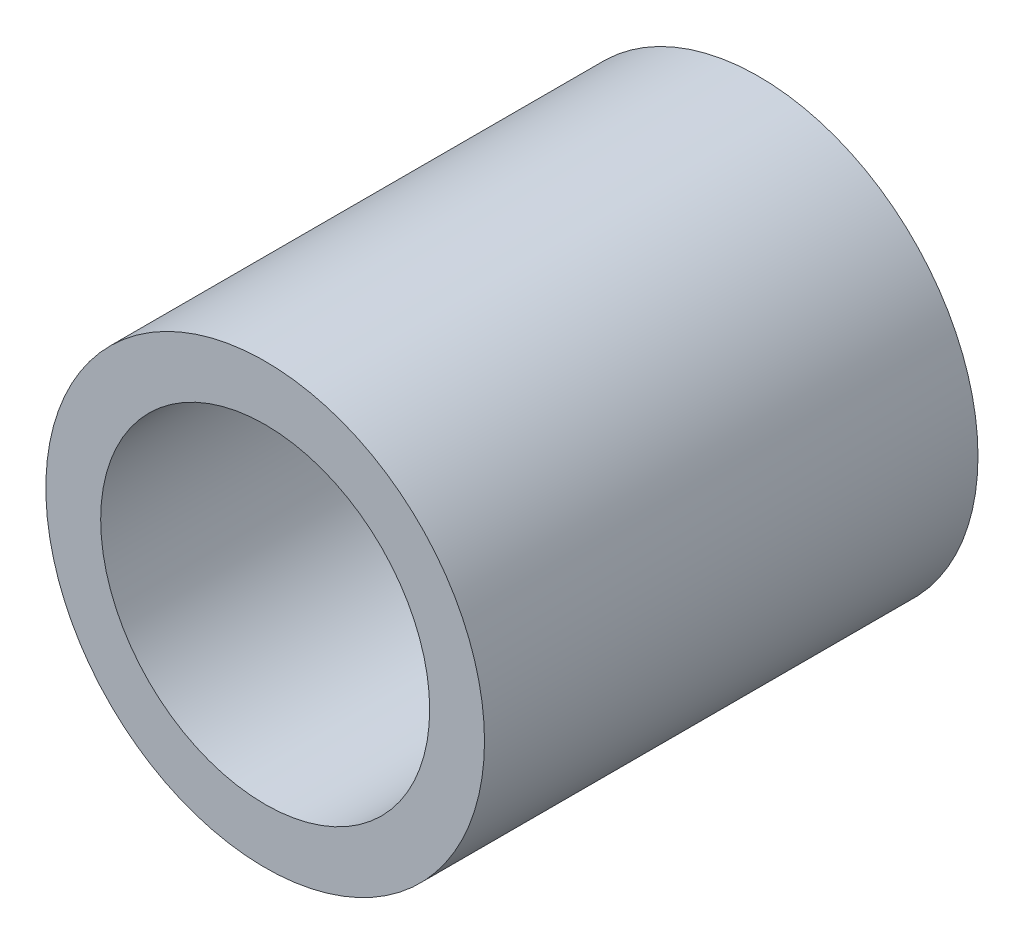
ISO-10303-21;
HEADER;
FILE_DESCRIPTION(('STEP AP214'),'2;1');
FILE_NAME('part.step','',(''),(''),'','','');
FILE_SCHEMA(('AUTOMOTIVE_DESIGN { 1 0 10303 214 1 1 1 1 }'));
ENDSEC;
DATA;
#1=APPLICATION_CONTEXT('core data for automotive mechanical design processes');
#2=APPLICATION_PROTOCOL_DEFINITION('international standard','automotive_design',2000,#1);
#3=PRODUCT_CONTEXT('',#1,'mechanical');
#4=PRODUCT('Part','Part','',(#3));
#5=PRODUCT_RELATED_PRODUCT_CATEGORY('part','',(#4));
#6=PRODUCT_DEFINITION_FORMATION('','',#4);
#7=PRODUCT_DEFINITION_CONTEXT('part definition',#1,'design');
#8=PRODUCT_DEFINITION('design','',#6,#7);
#9=PRODUCT_DEFINITION_SHAPE('','',#8);
#10=(LENGTH_UNIT() NAMED_UNIT(*) SI_UNIT(.MILLI.,.METRE.));
#11=(NAMED_UNIT(*) PLANE_ANGLE_UNIT() SI_UNIT($,.RADIAN.));
#12=(NAMED_UNIT(*) SI_UNIT($,.STERADIAN.) SOLID_ANGLE_UNIT());
#13=UNCERTAINTY_MEASURE_WITH_UNIT(LENGTH_MEASURE(1.E-05),#10,'distance_accuracy_value','');
#14=(GEOMETRIC_REPRESENTATION_CONTEXT(3) GLOBAL_UNCERTAINTY_ASSIGNED_CONTEXT((#13)) GLOBAL_UNIT_ASSIGNED_CONTEXT((#10,
#11,#12)) REPRESENTATION_CONTEXT('',''));
#15=CARTESIAN_POINT('',(0.,0.,0.));
#16=DIRECTION('',(0.,0.,1.));
#17=DIRECTION('',(1.,0.,0.));
#18=AXIS2_PLACEMENT_3D('',#15,#16,#17);
#19=CARTESIAN_POINT('',(0.,0.,64.4960244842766));
#20=DIRECTION('',(0.,0.,-1.));
#21=DIRECTION('',(-1.,0.,0.));
#22=AXIS2_PLACEMENT_3D('',#19,#20,#21);
#23=CYLINDRICAL_SURFACE('',#22,12.7);
#24=CARTESIAN_POINT('',(0.,0.,0.));
#25=DIRECTION('',(0.,0.,1.));
#26=DIRECTION('',(1.,0.,0.));
#27=AXIS2_PLACEMENT_3D('',#24,#25,#26);
#28=CIRCLE('',#27,12.7);
#29=CARTESIAN_POINT('',(12.7,0.,0.));
#30=VERTEX_POINT('',#29);
#31=EDGE_CURVE('E46',#30,#30,#28,.T.);
#32=ORIENTED_EDGE('',*,*,#31,.T.);
#33=EDGE_LOOP('',(#32));
#34=FACE_BOUND('',#33,.T.);
#35=CARTESIAN_POINT('',(0.,0.,28.575));
#36=DIRECTION('',(0.,0.,1.));
#37=DIRECTION('',(1.,0.,0.));
#38=AXIS2_PLACEMENT_3D('',#35,#36,#37);
#39=CIRCLE('',#38,12.7);
#40=CARTESIAN_POINT('',(12.7,0.,28.575));
#41=VERTEX_POINT('',#40);
#42=EDGE_CURVE('E10',#41,#41,#39,.T.);
#43=ORIENTED_EDGE('',*,*,#42,.F.);
#44=EDGE_LOOP('',(#43));
#45=FACE_BOUND('',#44,.T.);
#46=ADVANCED_FACE('F39',(#34,#45),#23,.T.);
#47=CARTESIAN_POINT('',(0.,0.,0.));
#48=DIRECTION('',(0.,0.,1.));
#49=DIRECTION('',(1.,0.,0.));
#50=AXIS2_PLACEMENT_3D('',#47,#48,#49);
#51=PLANE('',#50);
#52=CARTESIAN_POINT('',(0.,0.,0.));
#53=DIRECTION('',(0.,0.,1.));
#54=DIRECTION('',(1.,0.,0.));
#55=AXIS2_PLACEMENT_3D('',#52,#53,#54);
#56=CIRCLE('',#55,9.525);
#57=CARTESIAN_POINT('',(9.525,0.,0.));
#58=VERTEX_POINT('',#57);
#59=EDGE_CURVE('E50',#58,#58,#56,.T.);
#60=ORIENTED_EDGE('',*,*,#59,.T.);
#61=EDGE_LOOP('',(#60));
#62=FACE_BOUND('',#61,.T.);
#63=ORIENTED_EDGE('',*,*,#31,.F.);
#64=EDGE_LOOP('',(#63));
#65=FACE_BOUND('',#64,.T.);
#66=ADVANCED_FACE('F63',(#62,#65),#51,.F.);
#67=CARTESIAN_POINT('',(0.,0.,28.575));
#68=DIRECTION('',(0.,0.,1.));
#69=DIRECTION('',(1.,0.,0.));
#70=AXIS2_PLACEMENT_3D('',#67,#68,#69);
#71=PLANE('',#70);
#72=CARTESIAN_POINT('',(0.,0.,28.575));
#73=DIRECTION('',(0.,0.,1.));
#74=DIRECTION('',(1.,0.,0.));
#75=AXIS2_PLACEMENT_3D('',#72,#73,#74);
#76=CIRCLE('',#75,9.525);
#77=CARTESIAN_POINT('',(9.525,0.,28.575));
#78=VERTEX_POINT('',#77);
#79=EDGE_CURVE('E54',#78,#78,#76,.T.);
#80=ORIENTED_EDGE('',*,*,#79,.F.);
#81=EDGE_LOOP('',(#80));
#82=FACE_BOUND('',#81,.T.);
#83=ORIENTED_EDGE('',*,*,#42,.T.);
#84=EDGE_LOOP('',(#83));
#85=FACE_BOUND('',#84,.T.);
#86=ADVANCED_FACE('F41',(#82,#85),#71,.T.);
#87=CARTESIAN_POINT('',(0.,0.,0.));
#88=DIRECTION('',(0.,0.,1.));
#89=DIRECTION('',(1.,0.,0.));
#90=AXIS2_PLACEMENT_3D('',#87,#88,#89);
#91=CYLINDRICAL_SURFACE('',#90,9.525);
#92=ORIENTED_EDGE('',*,*,#59,.F.);
#93=EDGE_LOOP('',(#92));
#94=FACE_BOUND('',#93,.T.);
#95=ORIENTED_EDGE('',*,*,#79,.T.);
#96=EDGE_LOOP('',(#95));
#97=FACE_BOUND('',#96,.T.);
#98=ADVANCED_FACE('F60',(#94,#97),#91,.F.);
#99=CLOSED_SHELL('',(#46,#66,#86,#98));
#100=MANIFOLD_SOLID_BREP('B2',#99);
#101=ADVANCED_BREP_SHAPE_REPRESENTATION('',(#18,#100),#14);
#102=SHAPE_DEFINITION_REPRESENTATION(#9,#101);
ENDSEC;
END-ISO-10303-21;
